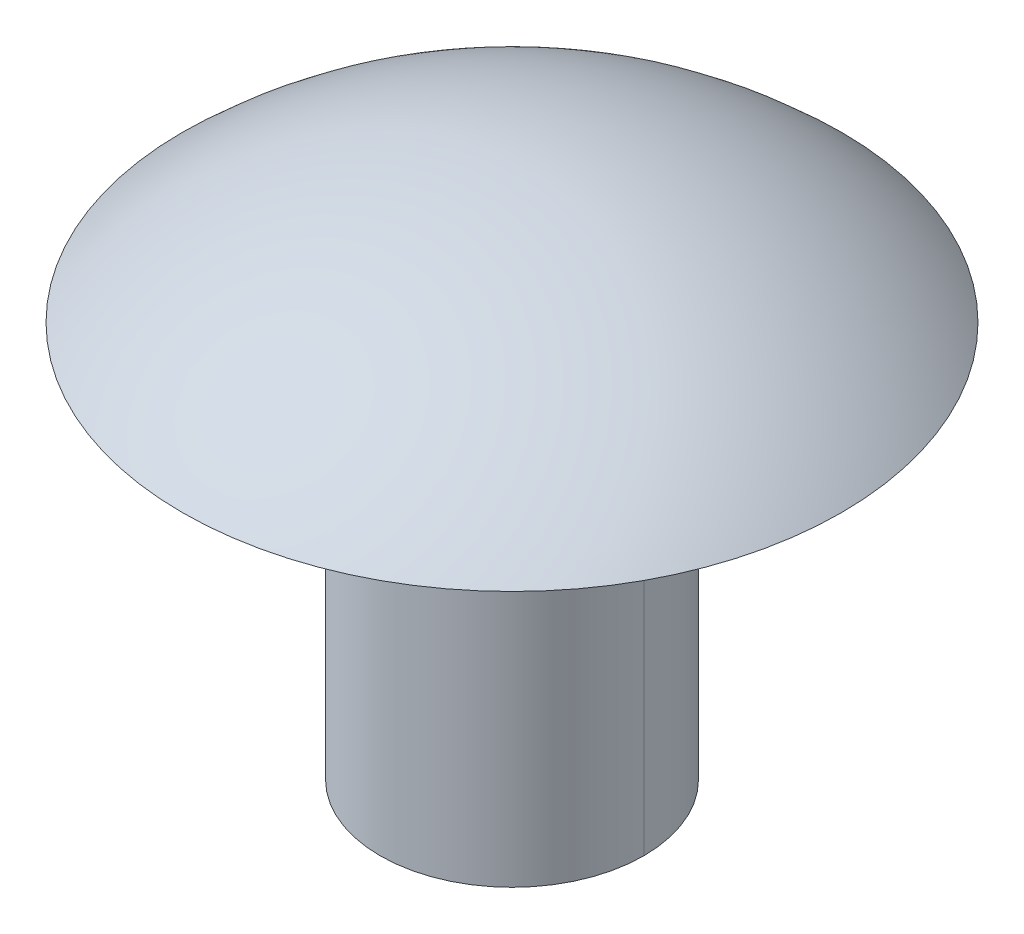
from build123d import *

# Parameters (mm, degrees)
SKETCH1_R           = 4.7625
BOSS_EXTRUDE1_DEPTH = 14.3002


with BuildPart() as part:
    # Sketch1 → Boss-Extrude1 (new body)
    with BuildSketch(Plane(origin=(0, 0, 0), x_dir=(1, 0, 0), z_dir=(0, 1, 0))):
        with Locations(Location((0, 0, 0), (0, 0, 270))):
            Circle(SKETCH1_R)
    extrude(amount=-BOSS_EXTRUDE1_DEPTH)

    # Sketch3 → Revolve1 (revolve)
    with BuildSketch(Plane.XY):
        with BuildLine():
            Line((0, 4.7498), (0, 0))
            Line((0, 0), (11.8999, 0))
            ThreePointArc((11.8999, 0), (6.406407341, 3.5184843), (0, 4.7498))
        make_face()
    revolve(axis=Axis((0, 4.7498, 0), (0, -1, 0)))


solid = part.part
